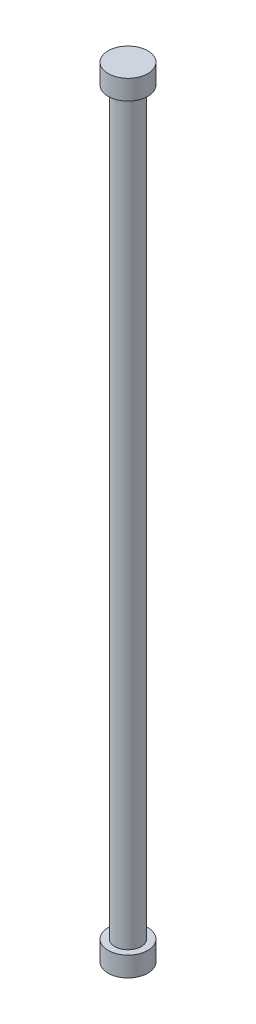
ISO-10303-21;
HEADER;
FILE_DESCRIPTION(('STEP AP214'),'2;1');
FILE_NAME('part.step','',(''),(''),'','','');
FILE_SCHEMA(('AUTOMOTIVE_DESIGN { 1 0 10303 214 1 1 1 1 }'));
ENDSEC;
DATA;
#1=APPLICATION_CONTEXT('core data for automotive mechanical design processes');
#2=APPLICATION_PROTOCOL_DEFINITION('international standard','automotive_design',2000,#1);
#3=PRODUCT_CONTEXT('',#1,'mechanical');
#4=PRODUCT('Part','Part','',(#3));
#5=PRODUCT_RELATED_PRODUCT_CATEGORY('part','',(#4));
#6=PRODUCT_DEFINITION_FORMATION('','',#4);
#7=PRODUCT_DEFINITION_CONTEXT('part definition',#1,'design');
#8=PRODUCT_DEFINITION('design','',#6,#7);
#9=PRODUCT_DEFINITION_SHAPE('','',#8);
#10=(LENGTH_UNIT() NAMED_UNIT(*) SI_UNIT(.MILLI.,.METRE.));
#11=(NAMED_UNIT(*) PLANE_ANGLE_UNIT() SI_UNIT($,.RADIAN.));
#12=(NAMED_UNIT(*) SI_UNIT($,.STERADIAN.) SOLID_ANGLE_UNIT());
#13=UNCERTAINTY_MEASURE_WITH_UNIT(LENGTH_MEASURE(1.E-05),#10,'distance_accuracy_value','');
#14=(GEOMETRIC_REPRESENTATION_CONTEXT(3) GLOBAL_UNCERTAINTY_ASSIGNED_CONTEXT((#13)) GLOBAL_UNIT_ASSIGNED_CONTEXT((#10,
#11,#12)) REPRESENTATION_CONTEXT('',''));
#15=CARTESIAN_POINT('',(0.,0.,0.));
#16=DIRECTION('',(0.,0.,1.));
#17=DIRECTION('',(1.,0.,0.));
#18=AXIS2_PLACEMENT_3D('',#15,#16,#17);
#19=CARTESIAN_POINT('',(0.,15.,0.));
#20=DIRECTION('',(0.,-1.,0.));
#21=DIRECTION('',(0.,0.,-1.));
#22=AXIS2_PLACEMENT_3D('',#19,#20,#21);
#23=CYLINDRICAL_SURFACE('',#22,15.);
#24=CARTESIAN_POINT('',(0.,15.,0.));
#25=DIRECTION('',(0.,1.,0.));
#26=DIRECTION('',(0.,0.,1.));
#27=AXIS2_PLACEMENT_3D('',#24,#25,#26);
#28=CIRCLE('',#27,15.);
#29=CARTESIAN_POINT('',(0.,15.,15.));
#30=VERTEX_POINT('',#29);
#31=EDGE_CURVE('E51',#30,#30,#28,.T.);
#32=ORIENTED_EDGE('',*,*,#31,.F.);
#33=EDGE_LOOP('',(#32));
#34=FACE_BOUND('',#33,.T.);
#35=CARTESIAN_POINT('',(0.,0.,0.));
#36=DIRECTION('',(0.,1.,0.));
#37=DIRECTION('',(0.,0.,1.));
#38=AXIS2_PLACEMENT_3D('',#35,#36,#37);
#39=CIRCLE('',#38,15.);
#40=CARTESIAN_POINT('',(0.,0.,15.));
#41=VERTEX_POINT('',#40);
#42=EDGE_CURVE('E46',#41,#41,#39,.T.);
#43=ORIENTED_EDGE('',*,*,#42,.T.);
#44=EDGE_LOOP('',(#43));
#45=FACE_BOUND('',#44,.T.);
#46=ADVANCED_FACE('F43',(#34,#45),#23,.T.);
#47=CARTESIAN_POINT('',(0.,15.,0.));
#48=DIRECTION('',(0.,1.,0.));
#49=DIRECTION('',(0.,0.,1.));
#50=AXIS2_PLACEMENT_3D('',#47,#48,#49);
#51=PLANE('',#50);
#52=CARTESIAN_POINT('',(0.,15.,0.));
#53=DIRECTION('',(0.,1.,0.));
#54=DIRECTION('',(0.,0.,1.));
#55=AXIS2_PLACEMENT_3D('',#52,#53,#54);
#56=CIRCLE('',#55,10.);
#57=CARTESIAN_POINT('',(0.,15.,10.));
#58=VERTEX_POINT('',#57);
#59=EDGE_CURVE('E10',#58,#58,#56,.T.);
#60=ORIENTED_EDGE('',*,*,#59,.F.);
#61=EDGE_LOOP('',(#60));
#62=FACE_BOUND('',#61,.T.);
#63=ORIENTED_EDGE('',*,*,#31,.T.);
#64=EDGE_LOOP('',(#63));
#65=FACE_BOUND('',#64,.T.);
#66=ADVANCED_FACE('F89',(#62,#65),#51,.T.);
#67=CARTESIAN_POINT('',(0.,0.,0.));
#68=DIRECTION('',(0.,1.,0.));
#69=DIRECTION('',(0.,0.,1.));
#70=AXIS2_PLACEMENT_3D('',#67,#68,#69);
#71=PLANE('',#70);
#72=ORIENTED_EDGE('',*,*,#42,.F.);
#73=EDGE_LOOP('',(#72));
#74=FACE_BOUND('',#73,.T.);
#75=ADVANCED_FACE('F95',(#74),#71,.F.);
#76=CARTESIAN_POINT('',(0.,575.5,0.));
#77=DIRECTION('',(0.,-1.,0.));
#78=DIRECTION('',(0.,0.,-1.));
#79=AXIS2_PLACEMENT_3D('',#76,#77,#78);
#80=CYLINDRICAL_SURFACE('',#79,10.);
#81=CARTESIAN_POINT('',(0.,575.5,0.));
#82=DIRECTION('',(0.,1.,0.));
#83=DIRECTION('',(0.,0.,1.));
#84=AXIS2_PLACEMENT_3D('',#81,#82,#83);
#85=CIRCLE('',#84,10.);
#86=CARTESIAN_POINT('',(0.,575.5,10.));
#87=VERTEX_POINT('',#86);
#88=EDGE_CURVE('E58',#87,#87,#85,.T.);
#89=ORIENTED_EDGE('',*,*,#88,.F.);
#90=EDGE_LOOP('',(#89));
#91=FACE_BOUND('',#90,.T.);
#92=ORIENTED_EDGE('',*,*,#59,.T.);
#93=EDGE_LOOP('',(#92));
#94=FACE_BOUND('',#93,.T.);
#95=ADVANCED_FACE('F76',(#91,#94),#80,.T.);
#96=CARTESIAN_POINT('',(0.,590.5,0.));
#97=DIRECTION('',(0.,-1.,0.));
#98=DIRECTION('',(0.,0.,-1.));
#99=AXIS2_PLACEMENT_3D('',#96,#97,#98);
#100=CYLINDRICAL_SURFACE('',#99,15.);
#101=CARTESIAN_POINT('',(0.,590.5,0.));
#102=DIRECTION('',(0.,1.,0.));
#103=DIRECTION('',(0.,0.,1.));
#104=AXIS2_PLACEMENT_3D('',#101,#102,#103);
#105=CIRCLE('',#104,15.);
#106=CARTESIAN_POINT('',(0.,590.5,15.));
#107=VERTEX_POINT('',#106);
#108=EDGE_CURVE('E62',#107,#107,#105,.T.);
#109=ORIENTED_EDGE('',*,*,#108,.F.);
#110=EDGE_LOOP('',(#109));
#111=FACE_BOUND('',#110,.T.);
#112=CARTESIAN_POINT('',(0.,575.5,0.));
#113=DIRECTION('',(0.,1.,0.));
#114=DIRECTION('',(0.,0.,1.));
#115=AXIS2_PLACEMENT_3D('',#112,#113,#114);
#116=CIRCLE('',#115,15.);
#117=CARTESIAN_POINT('',(0.,575.5,15.));
#118=VERTEX_POINT('',#117);
#119=EDGE_CURVE('E63',#118,#118,#116,.T.);
#120=ORIENTED_EDGE('',*,*,#119,.T.);
#121=EDGE_LOOP('',(#120));
#122=FACE_BOUND('',#121,.T.);
#123=ADVANCED_FACE('F73',(#111,#122),#100,.T.);
#124=CARTESIAN_POINT('',(0.,590.5,0.));
#125=DIRECTION('',(0.,1.,0.));
#126=DIRECTION('',(0.,0.,1.));
#127=AXIS2_PLACEMENT_3D('',#124,#125,#126);
#128=PLANE('',#127);
#129=ORIENTED_EDGE('',*,*,#108,.T.);
#130=EDGE_LOOP('',(#129));
#131=FACE_BOUND('',#130,.T.);
#132=ADVANCED_FACE('F71',(#131),#128,.T.);
#133=CARTESIAN_POINT('',(0.,575.5,0.));
#134=DIRECTION('',(0.,1.,0.));
#135=DIRECTION('',(0.,0.,1.));
#136=AXIS2_PLACEMENT_3D('',#133,#134,#135);
#137=PLANE('',#136);
#138=ORIENTED_EDGE('',*,*,#88,.T.);
#139=EDGE_LOOP('',(#138));
#140=FACE_BOUND('',#139,.T.);
#141=ORIENTED_EDGE('',*,*,#119,.F.);
#142=EDGE_LOOP('',(#141));
#143=FACE_BOUND('',#142,.T.);
#144=ADVANCED_FACE('F80',(#140,#143),#137,.F.);
#145=CLOSED_SHELL('',(#46,#66,#75,#95,#123,#132,#144));
#146=MANIFOLD_SOLID_BREP('B2',#145);
#147=ADVANCED_BREP_SHAPE_REPRESENTATION('',(#18,#146),#14);
#148=SHAPE_DEFINITION_REPRESENTATION(#9,#147);
ENDSEC;
END-ISO-10303-21;
